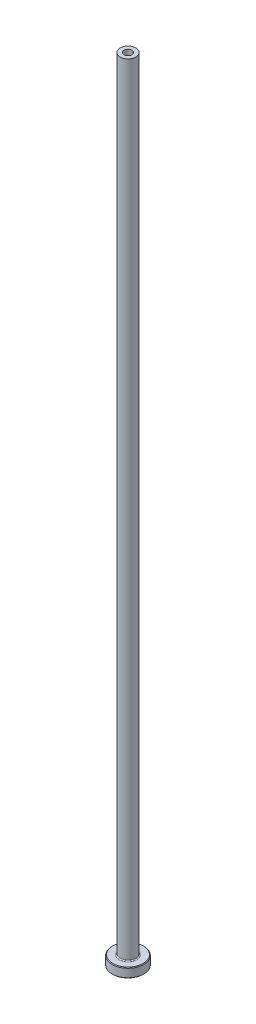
ISO-10303-21;
HEADER;
FILE_DESCRIPTION(('STEP AP214'),'2;1');
FILE_NAME('part.step','',(''),(''),'','','');
FILE_SCHEMA(('AUTOMOTIVE_DESIGN { 1 0 10303 214 1 1 1 1 }'));
ENDSEC;
DATA;
#1=APPLICATION_CONTEXT('core data for automotive mechanical design processes');
#2=APPLICATION_PROTOCOL_DEFINITION('international standard','automotive_design',2000,#1);
#3=PRODUCT_CONTEXT('',#1,'mechanical');
#4=PRODUCT('Part','Part','',(#3));
#5=PRODUCT_RELATED_PRODUCT_CATEGORY('part','',(#4));
#6=PRODUCT_DEFINITION_FORMATION('','',#4);
#7=PRODUCT_DEFINITION_CONTEXT('part definition',#1,'design');
#8=PRODUCT_DEFINITION('design','',#6,#7);
#9=PRODUCT_DEFINITION_SHAPE('','',#8);
#10=(LENGTH_UNIT() NAMED_UNIT(*) SI_UNIT(.MILLI.,.METRE.));
#11=(NAMED_UNIT(*) PLANE_ANGLE_UNIT() SI_UNIT($,.RADIAN.));
#12=(NAMED_UNIT(*) SI_UNIT($,.STERADIAN.) SOLID_ANGLE_UNIT());
#13=UNCERTAINTY_MEASURE_WITH_UNIT(LENGTH_MEASURE(1.E-05),#10,'distance_accuracy_value','');
#14=(GEOMETRIC_REPRESENTATION_CONTEXT(3) GLOBAL_UNCERTAINTY_ASSIGNED_CONTEXT((#13)) GLOBAL_UNIT_ASSIGNED_CONTEXT((#10,
#11,#12)) REPRESENTATION_CONTEXT('',''));
#15=CARTESIAN_POINT('',(0.,0.,0.));
#16=DIRECTION('',(0.,0.,1.));
#17=DIRECTION('',(1.,0.,0.));
#18=AXIS2_PLACEMENT_3D('',#15,#16,#17);
#19=CARTESIAN_POINT('',(0.,92.1876809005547,0.));
#20=DIRECTION('',(0.,1.,0.));
#21=DIRECTION('',(0.,0.,1.));
#22=AXIS2_PLACEMENT_3D('',#19,#20,#21);
#23=CYLINDRICAL_SURFACE('',#22,1.25000000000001);
#24=CARTESIAN_POINT('',(0.,250.,0.));
#25=DIRECTION('',(0.,1.,0.));
#26=DIRECTION('',(0.,0.,1.));
#27=AXIS2_PLACEMENT_3D('',#24,#25,#26);
#28=CIRCLE('',#27,1.25000000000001);
#29=CARTESIAN_POINT('',(0.,250.,1.25000000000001));
#30=VERTEX_POINT('',#29);
#31=EDGE_CURVE('E62',#30,#30,#28,.T.);
#32=ORIENTED_EDGE('',*,*,#31,.T.);
#33=EDGE_LOOP('',(#32));
#34=FACE_BOUND('',#33,.T.);
#35=CARTESIAN_POINT('',(0.,215.,0.));
#36=DIRECTION('',(0.,1.,0.));
#37=DIRECTION('',(0.,0.,1.));
#38=AXIS2_PLACEMENT_3D('',#35,#36,#37);
#39=CIRCLE('',#38,1.25000000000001);
#40=CARTESIAN_POINT('',(0.,215.,1.25000000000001));
#41=VERTEX_POINT('',#40);
#42=EDGE_CURVE('E71',#41,#41,#39,.T.);
#43=ORIENTED_EDGE('',*,*,#42,.F.);
#44=EDGE_LOOP('',(#43));
#45=FACE_BOUND('',#44,.T.);
#46=ADVANCED_FACE('F30',(#34,#45),#23,.F.);
#47=CARTESIAN_POINT('',(-1.25000000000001,250.,0.));
#48=DIRECTION('',(0.,1.,0.));
#49=DIRECTION('',(0.,0.,1.));
#50=AXIS2_PLACEMENT_3D('',#47,#48,#49);
#51=PLANE('',#50);
#52=CARTESIAN_POINT('',(0.,250.,0.));
#53=DIRECTION('',(0.,1.,0.));
#54=DIRECTION('',(0.,0.,1.));
#55=AXIS2_PLACEMENT_3D('',#52,#53,#54);
#56=CIRCLE('',#55,2.50000000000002);
#57=CARTESIAN_POINT('',(0.,250.,2.50000000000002));
#58=VERTEX_POINT('',#57);
#59=EDGE_CURVE('E65',#58,#58,#56,.T.);
#60=ORIENTED_EDGE('',*,*,#59,.T.);
#61=EDGE_LOOP('',(#60));
#62=FACE_BOUND('',#61,.T.);
#63=ORIENTED_EDGE('',*,*,#31,.F.);
#64=EDGE_LOOP('',(#63));
#65=FACE_BOUND('',#64,.T.);
#66=ADVANCED_FACE('F79',(#62,#65),#51,.T.);
#67=CARTESIAN_POINT('',(0.,92.1876809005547,0.));
#68=DIRECTION('',(0.,1.,0.));
#69=DIRECTION('',(0.,0.,1.));
#70=AXIS2_PLACEMENT_3D('',#67,#68,#69);
#71=CYLINDRICAL_SURFACE('',#70,2.5);
#72=CARTESIAN_POINT('',(0.,3.3,0.));
#73=DIRECTION('',(0.,1.,0.));
#74=DIRECTION('',(0.,0.,1.));
#75=AXIS2_PLACEMENT_3D('',#72,#73,#74);
#76=CIRCLE('',#75,2.5);
#77=CARTESIAN_POINT('',(0.,3.3,2.5));
#78=VERTEX_POINT('',#77);
#79=EDGE_CURVE('E59',#78,#78,#76,.T.);
#80=ORIENTED_EDGE('',*,*,#79,.T.);
#81=EDGE_LOOP('',(#80));
#82=FACE_BOUND('',#81,.T.);
#83=ORIENTED_EDGE('',*,*,#59,.F.);
#84=EDGE_LOOP('',(#83));
#85=FACE_BOUND('',#84,.T.);
#86=ADVANCED_FACE('F85',(#82,#85),#71,.T.);
#87=CARTESIAN_POINT('',(-2.49999999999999,3.,0.));
#88=DIRECTION('',(0.,1.,0.));
#89=DIRECTION('',(0.,0.,1.));
#90=AXIS2_PLACEMENT_3D('',#87,#88,#89);
#91=PLANE('',#90);
#92=CARTESIAN_POINT('',(0.,3.,0.));
#93=DIRECTION('',(0.,1.,0.));
#94=DIRECTION('',(0.,0.,1.));
#95=AXIS2_PLACEMENT_3D('',#92,#93,#94);
#96=CIRCLE('',#95,4.8);
#97=CARTESIAN_POINT('',(0.,3.,4.8));
#98=VERTEX_POINT('',#97);
#99=EDGE_CURVE('E53',#98,#98,#96,.T.);
#100=ORIENTED_EDGE('',*,*,#99,.T.);
#101=EDGE_LOOP('',(#100));
#102=FACE_BOUND('',#101,.T.);
#103=CARTESIAN_POINT('',(0.,3.,0.));
#104=DIRECTION('',(0.,1.,0.));
#105=DIRECTION('',(0.,0.,1.));
#106=AXIS2_PLACEMENT_3D('',#103,#104,#105);
#107=CIRCLE('',#106,2.8);
#108=CARTESIAN_POINT('',(0.,3.,2.8));
#109=VERTEX_POINT('',#108);
#110=EDGE_CURVE('E56',#109,#109,#107,.F.);
#111=ORIENTED_EDGE('',*,*,#110,.T.);
#112=EDGE_LOOP('',(#111));
#113=FACE_BOUND('',#112,.T.);
#114=ADVANCED_FACE('F111',(#102,#113),#91,.T.);
#115=CARTESIAN_POINT('',(0.,92.1876809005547,0.));
#116=DIRECTION('',(0.,1.,0.));
#117=DIRECTION('',(0.,0.,1.));
#118=AXIS2_PLACEMENT_3D('',#115,#116,#117);
#119=CYLINDRICAL_SURFACE('',#118,4.99999999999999);
#120=CARTESIAN_POINT('',(0.,2.80000000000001,0.));
#121=DIRECTION('',(0.,1.,0.));
#122=DIRECTION('',(0.,0.,1.));
#123=AXIS2_PLACEMENT_3D('',#120,#121,#122);
#124=CIRCLE('',#123,4.99999999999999);
#125=CARTESIAN_POINT('',(0.,2.80000000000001,4.99999999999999));
#126=VERTEX_POINT('',#125);
#127=EDGE_CURVE('E45',#126,#126,#124,.F.);
#128=ORIENTED_EDGE('',*,*,#127,.T.);
#129=EDGE_LOOP('',(#128));
#130=FACE_BOUND('',#129,.T.);
#131=CARTESIAN_POINT('',(0.,0.200000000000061,0.));
#132=DIRECTION('',(0.,-1.,0.));
#133=DIRECTION('',(0.,0.,-1.));
#134=AXIS2_PLACEMENT_3D('',#131,#132,#133);
#135=CIRCLE('',#134,4.99999999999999);
#136=CARTESIAN_POINT('',(0.,0.200000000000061,-4.99999999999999));
#137=VERTEX_POINT('',#136);
#138=EDGE_CURVE('E50',#137,#137,#135,.F.);
#139=ORIENTED_EDGE('',*,*,#138,.T.);
#140=EDGE_LOOP('',(#139));
#141=FACE_BOUND('',#140,.T.);
#142=ADVANCED_FACE('F108',(#130,#141),#119,.T.);
#143=CARTESIAN_POINT('',(-4.99999999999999,0.,0.));
#144=DIRECTION('',(0.,-1.,0.));
#145=DIRECTION('',(0.,0.,-1.));
#146=AXIS2_PLACEMENT_3D('',#143,#144,#145);
#147=PLANE('',#146);
#148=CARTESIAN_POINT('',(0.,0.,0.));
#149=DIRECTION('',(0.,-1.,0.));
#150=DIRECTION('',(0.,0.,-1.));
#151=AXIS2_PLACEMENT_3D('',#148,#149,#150);
#152=CIRCLE('',#151,2.00000000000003);
#153=CARTESIAN_POINT('',(0.,0.,-2.00000000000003));
#154=VERTEX_POINT('',#153);
#155=EDGE_CURVE('E37',#154,#154,#152,.F.);
#156=ORIENTED_EDGE('',*,*,#155,.T.);
#157=EDGE_LOOP('',(#156));
#158=FACE_BOUND('',#157,.T.);
#159=CARTESIAN_POINT('',(0.,0.,0.));
#160=DIRECTION('',(0.,-1.,0.));
#161=DIRECTION('',(0.,0.,-1.));
#162=AXIS2_PLACEMENT_3D('',#159,#160,#161);
#163=CIRCLE('',#162,4.79999999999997);
#164=CARTESIAN_POINT('',(0.,0.,-4.79999999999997));
#165=VERTEX_POINT('',#164);
#166=EDGE_CURVE('E41',#165,#165,#163,.T.);
#167=ORIENTED_EDGE('',*,*,#166,.T.);
#168=EDGE_LOOP('',(#167));
#169=FACE_BOUND('',#168,.T.);
#170=ADVANCED_FACE('F110',(#158,#169),#147,.T.);
#171=CARTESIAN_POINT('',(0.,92.1876809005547,0.));
#172=DIRECTION('',(0.,1.,0.));
#173=DIRECTION('',(0.,0.,1.));
#174=AXIS2_PLACEMENT_3D('',#171,#172,#173);
#175=CYLINDRICAL_SURFACE('',#174,1.5);
#176=CARTESIAN_POINT('',(0.,0.500000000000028,0.));
#177=DIRECTION('',(0.,-1.,0.));
#178=DIRECTION('',(0.,0.,-1.));
#179=AXIS2_PLACEMENT_3D('',#176,#177,#178);
#180=CIRCLE('',#179,1.5);
#181=CARTESIAN_POINT('',(0.,0.500000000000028,-1.5));
#182=VERTEX_POINT('',#181);
#183=EDGE_CURVE('E10',#182,#182,#180,.T.);
#184=ORIENTED_EDGE('',*,*,#183,.T.);
#185=EDGE_LOOP('',(#184));
#186=FACE_BOUND('',#185,.T.);
#187=CARTESIAN_POINT('',(0.,203.,0.));
#188=DIRECTION('',(0.,1.,0.));
#189=DIRECTION('',(0.,0.,1.));
#190=AXIS2_PLACEMENT_3D('',#187,#188,#189);
#191=CIRCLE('',#190,1.50000000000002);
#192=CARTESIAN_POINT('',(0.,203.,1.50000000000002));
#193=VERTEX_POINT('',#192);
#194=EDGE_CURVE('E68',#193,#193,#191,.T.);
#195=ORIENTED_EDGE('',*,*,#194,.T.);
#196=EDGE_LOOP('',(#195));
#197=FACE_BOUND('',#196,.T.);
#198=ADVANCED_FACE('F118',(#186,#197),#175,.F.);
#199=CARTESIAN_POINT('',(0.,203.,0.));
#200=DIRECTION('',(0.,-1.,0.));
#201=DIRECTION('',(0.,0.,-1.));
#202=AXIS2_PLACEMENT_3D('',#199,#200,#201);
#203=CONICAL_SURFACE('',#202,1.50000000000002,0.0208303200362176);
#204=ORIENTED_EDGE('',*,*,#42,.T.);
#205=EDGE_LOOP('',(#204));
#206=FACE_BOUND('',#205,.T.);
#207=ORIENTED_EDGE('',*,*,#194,.F.);
#208=EDGE_LOOP('',(#207));
#209=FACE_BOUND('',#208,.T.);
#210=ADVANCED_FACE('F75',(#206,#209),#203,.F.);
#211=CARTESIAN_POINT('',(0.,3.3,0.));
#212=DIRECTION('',(0.,1.,0.));
#213=DIRECTION('',(0.,0.,1.));
#214=AXIS2_PLACEMENT_3D('',#211,#212,#213);
#215=TOROIDAL_SURFACE('',#214,2.8,0.3);
#216=ORIENTED_EDGE('',*,*,#110,.F.);
#217=EDGE_LOOP('',(#216));
#218=FACE_BOUND('',#217,.T.);
#219=ORIENTED_EDGE('',*,*,#79,.F.);
#220=EDGE_LOOP('',(#219));
#221=FACE_BOUND('',#220,.T.);
#222=ADVANCED_FACE('F90',(#218,#221),#215,.F.);
#223=CARTESIAN_POINT('',(0.,3.,0.));
#224=DIRECTION('',(0.,-1.,0.));
#225=DIRECTION('',(0.,0.,-1.));
#226=AXIS2_PLACEMENT_3D('',#223,#224,#225);
#227=CONICAL_SURFACE('',#226,4.8,0.785398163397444);
#228=ORIENTED_EDGE('',*,*,#127,.F.);
#229=EDGE_LOOP('',(#228));
#230=FACE_BOUND('',#229,.T.);
#231=ORIENTED_EDGE('',*,*,#99,.F.);
#232=EDGE_LOOP('',(#231));
#233=FACE_BOUND('',#232,.T.);
#234=ADVANCED_FACE('F93',(#230,#233),#227,.T.);
#235=CARTESIAN_POINT('',(0.,0.200000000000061,0.));
#236=DIRECTION('',(0.,1.,0.));
#237=DIRECTION('',(0.,0.,1.));
#238=AXIS2_PLACEMENT_3D('',#235,#236,#237);
#239=CONICAL_SURFACE('',#238,4.99999999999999,0.78539816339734);
#240=ORIENTED_EDGE('',*,*,#166,.F.);
#241=EDGE_LOOP('',(#240));
#242=FACE_BOUND('',#241,.T.);
#243=ORIENTED_EDGE('',*,*,#138,.F.);
#244=EDGE_LOOP('',(#243));
#245=FACE_BOUND('',#244,.T.);
#246=ADVANCED_FACE('F96',(#242,#245),#239,.T.);
#247=CARTESIAN_POINT('',(0.,0.,0.));
#248=DIRECTION('',(0.,-1.,0.));
#249=DIRECTION('',(0.,0.,-1.));
#250=AXIS2_PLACEMENT_3D('',#247,#248,#249);
#251=CONICAL_SURFACE('',#250,2.00000000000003,0.785398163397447);
#252=ORIENTED_EDGE('',*,*,#183,.F.);
#253=EDGE_LOOP('',(#252));
#254=FACE_BOUND('',#253,.T.);
#255=ORIENTED_EDGE('',*,*,#155,.F.);
#256=EDGE_LOOP('',(#255));
#257=FACE_BOUND('',#256,.T.);
#258=ADVANCED_FACE('F32',(#254,#257),#251,.F.);
#259=CLOSED_SHELL('',(#46,#66,#86,#114,#142,#170,#198,#210,#222,#234,#246,#258));
#260=MANIFOLD_SOLID_BREP('B2',#259);
#261=ADVANCED_BREP_SHAPE_REPRESENTATION('',(#18,#260),#14);
#262=SHAPE_DEFINITION_REPRESENTATION(#9,#261);
ENDSEC;
END-ISO-10303-21;
